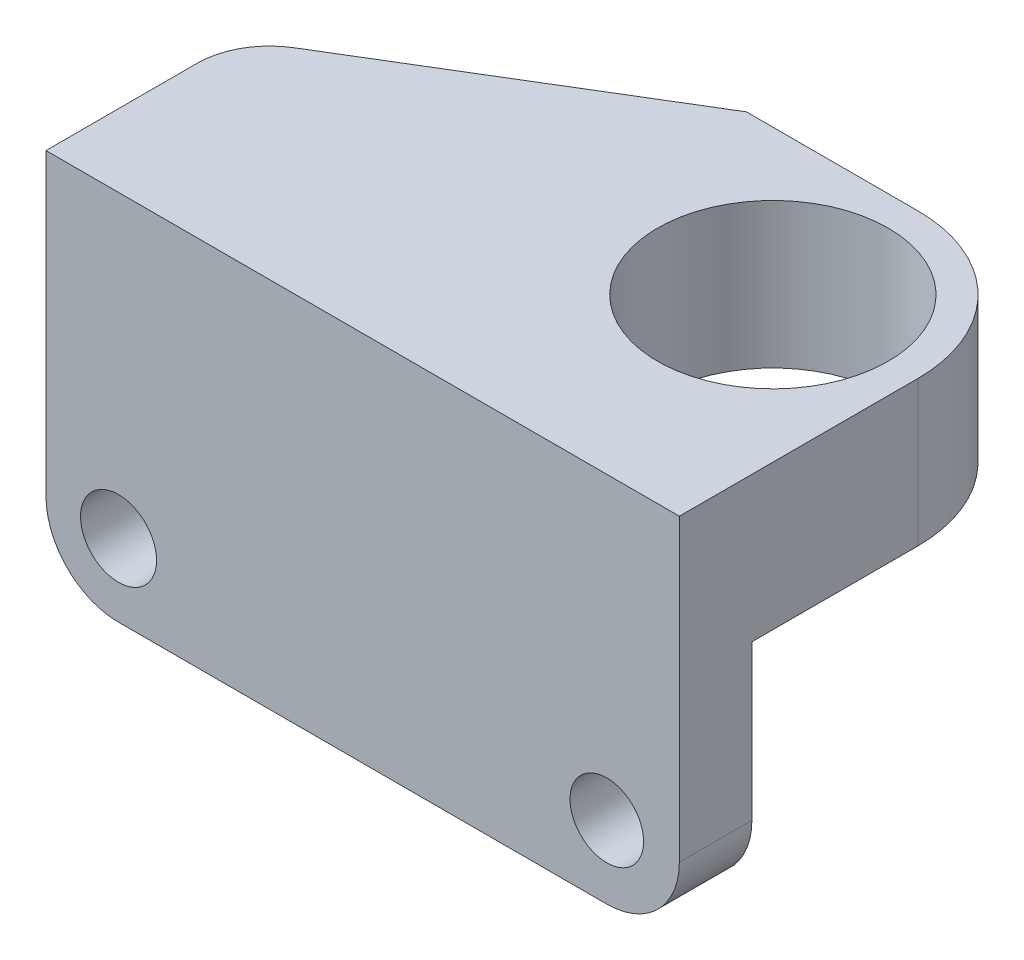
from build123d import *

# Parameters (mm, degrees)
CROQUIS1_W     = 87.307279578
CROQUIS1_H     = 51.311298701
EXTRUIR1_DEPTH = 10
CROQUIS2_R     = 5.239461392
CROQUIS2_R_2   = 5.071795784
EXTRUIR2_DEPTH = 10
REDONDEO1_R    = 10
EXTRUIR3_DEPTH = 10
REDONDEO2_R    = 20
REDONDEO3_R    = 10
EXTRUIR4_START = 10
CROQUIS4_R     = 20
EXTRUIR4_DEPTH = 10
CROQUIS6_W     = 40
CROQUIS6_H     = 22.893544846
EXTRUIR5_DEPTH = 10
CROQUIS7_R     = 15.90542573
EXTRUIR6_DEPTH = 70


with BuildPart() as part:
    # Croquis1 → Extruir1 (new body)
    with BuildSketch(Plane.XY):
        with Locations((43.653639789, 25.655649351)):
            Rectangle(CROQUIS1_W, CROQUIS1_H)
    extrude(amount=EXTRUIR1_DEPTH)

    # Croquis2 → Extruir2 (cut)
    with BuildSketch(Plane.XY.offset(10)):
        with Locations((10, 10)):
            Circle(CROQUIS2_R)
        with Locations((77.307279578, 10)):
            Circle(CROQUIS2_R_2)
    extrude(amount=-EXTRUIR2_DEPTH, mode=Mode.SUBTRACT)

    # Redondeo1
    redondeo1_edges = [part.edges().sort_by_distance(p)[0] for p in [
        (87.307279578, 0, 5),
        (0, 0, 5),
    ]]
    fillet(redondeo1_edges, radius=REDONDEO1_R)

    # Croquis3 → Extruir3 (add)
    with BuildSketch(Plane(origin=(0, 51.311298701, 0), x_dir=(1, 0, 0), z_dir=(0, 1, 0))):
        Polygon((43.653639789, 42.893544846), (0, 16.446772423), (0, -10), (87.307279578, -10), (87.307279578, 42.893544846), align=None)
    extrude(amount=-EXTRUIR3_DEPTH)

    # Redondeo2
    redondeo2_edges = [part.edges().sort_by_distance(p)[0] for p in [
        (87.307279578, 46.311298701, -42.893544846),
    ]]
    fillet(redondeo2_edges, radius=REDONDEO2_R)

    # Redondeo3
    redondeo3_edges = [part.edges().sort_by_distance(p)[0] for p in [
        (0, 46.311298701, -16.446772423),
    ]]
    fillet(redondeo3_edges, radius=REDONDEO3_R)

    # Croquis4 → Extruir4 (add)
    with BuildSketch(Plane.XZ.offset(-41.311298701).offset(EXTRUIR4_START)):
        with Locations(Location((67.307279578, -22.893544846, 0), (0, 0, 270))):
            Circle(CROQUIS4_R)
    extrude(amount=-EXTRUIR4_DEPTH)

    # Croquis6 → Extruir5 (add)
    with BuildSketch(Plane.XZ.offset(-31.311298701)):
        with Locations((67.307279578, -11.446772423)):
            Rectangle(CROQUIS6_W, CROQUIS6_H)
    extrude(amount=-EXTRUIR5_DEPTH)

    # Croquis7 → Extruir6 (cut)
    with BuildSketch(Plane.XZ.offset(-31.311298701)):
        with Locations(Location((67.307279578, -22.893544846, 0), (0, 0, 270))):
            Circle(CROQUIS7_R)
    extrude(amount=-EXTRUIR6_DEPTH, mode=Mode.SUBTRACT)


solid = part.part
